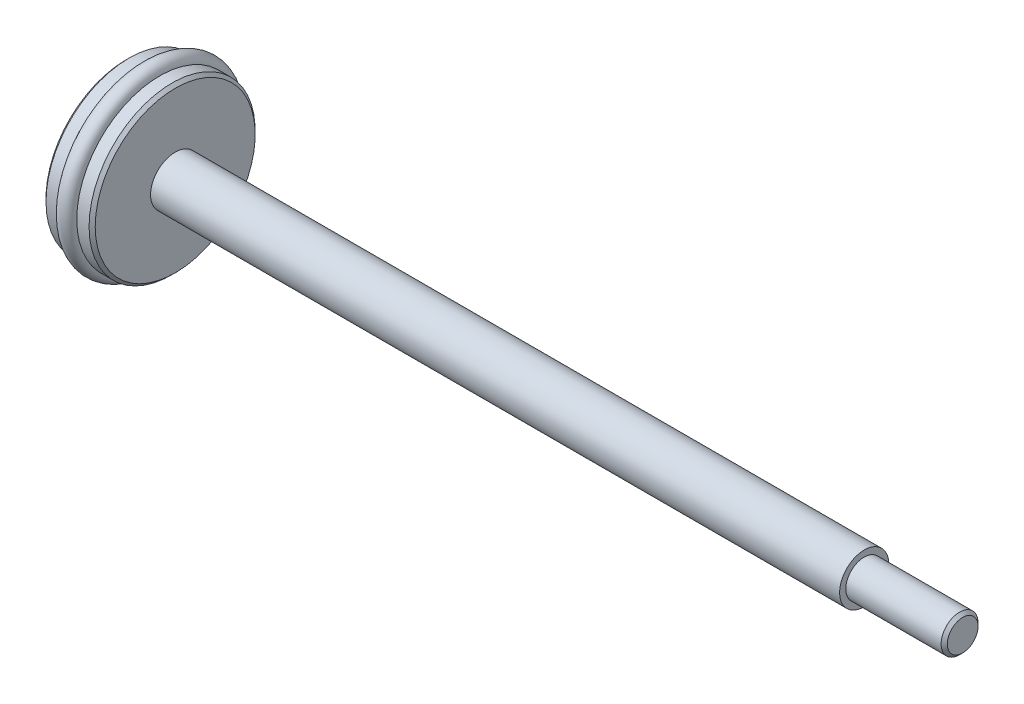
ISO-10303-21;
HEADER;
FILE_DESCRIPTION(('STEP AP214'),'2;1');
FILE_NAME('part.step','',(''),(''),'','','');
FILE_SCHEMA(('AUTOMOTIVE_DESIGN { 1 0 10303 214 1 1 1 1 }'));
ENDSEC;
DATA;
#1=APPLICATION_CONTEXT('core data for automotive mechanical design processes');
#2=APPLICATION_PROTOCOL_DEFINITION('international standard','automotive_design',2000,#1);
#3=PRODUCT_CONTEXT('',#1,'mechanical');
#4=PRODUCT('Part','Part','',(#3));
#5=PRODUCT_RELATED_PRODUCT_CATEGORY('part','',(#4));
#6=PRODUCT_DEFINITION_FORMATION('','',#4);
#7=PRODUCT_DEFINITION_CONTEXT('part definition',#1,'design');
#8=PRODUCT_DEFINITION('design','',#6,#7);
#9=PRODUCT_DEFINITION_SHAPE('','',#8);
#10=(LENGTH_UNIT() NAMED_UNIT(*) SI_UNIT(.MILLI.,.METRE.));
#11=(NAMED_UNIT(*) PLANE_ANGLE_UNIT() SI_UNIT($,.RADIAN.));
#12=(NAMED_UNIT(*) SI_UNIT($,.STERADIAN.) SOLID_ANGLE_UNIT());
#13=UNCERTAINTY_MEASURE_WITH_UNIT(LENGTH_MEASURE(1.E-05),#10,'distance_accuracy_value','');
#14=(GEOMETRIC_REPRESENTATION_CONTEXT(3) GLOBAL_UNCERTAINTY_ASSIGNED_CONTEXT((#13)) GLOBAL_UNIT_ASSIGNED_CONTEXT((#10,
#11,#12)) REPRESENTATION_CONTEXT('',''));
#15=CARTESIAN_POINT('',(0.,0.,0.));
#16=DIRECTION('',(0.,0.,1.));
#17=DIRECTION('',(1.,0.,0.));
#18=AXIS2_PLACEMENT_3D('',#15,#16,#17);
#19=CARTESIAN_POINT('',(7.99404103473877,0.,0.));
#20=DIRECTION('',(-1.,0.,0.));
#21=DIRECTION('',(0.,0.,1.));
#22=AXIS2_PLACEMENT_3D('',#19,#20,#21);
#23=TOROIDAL_SURFACE('',#22,26.7256412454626,2.77304253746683);
#24=CARTESIAN_POINT('',(7.99404103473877,0.,29.4986837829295));
#25=VERTEX_POINT('',#24);
#26=VERTEX_LOOP('',#25);
#27=FACE_BOUND('',#26,.T.);
#28=ADVANCED_FACE('F38',(#27),#23,.T.);
#29=CLOSED_SHELL('',(#28));
#30=MANIFOLD_SOLID_BREP('B2',#29);
#31=CARTESIAN_POINT('',(0.,26.,0.));
#32=DIRECTION('',(1.,0.,0.));
#33=DIRECTION('',(0.,0.,-1.));
#34=AXIS2_PLACEMENT_3D('',#31,#32,#33);
#35=PLANE('',#34);
#36=CARTESIAN_POINT('',(0.,0.,0.));
#37=DIRECTION('',(-1.,0.,0.));
#38=DIRECTION('',(0.,0.,1.));
#39=AXIS2_PLACEMENT_3D('',#36,#37,#38);
#40=CIRCLE('',#39,26.);
#41=CARTESIAN_POINT('',(0.,0.,-26.));
#42=VERTEX_POINT('',#41);
#43=EDGE_CURVE('E37',#42,#42,#40,.T.);
#44=ORIENTED_EDGE('',*,*,#43,.T.);
#45=EDGE_LOOP('',(#44));
#46=FACE_BOUND('',#45,.T.);
#47=ADVANCED_FACE('F48',(#46),#35,.F.);
#48=CARTESIAN_POINT('',(1.,0.,0.));
#49=DIRECTION('',(1.,0.,0.));
#50=DIRECTION('',(0.,0.,-1.));
#51=AXIS2_PLACEMENT_3D('',#48,#49,#50);
#52=CONICAL_SURFACE('',#51,27.,0.78539816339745);
#53=CARTESIAN_POINT('',(1.,0.,0.));
#54=DIRECTION('',(-1.,0.,0.));
#55=DIRECTION('',(0.,0.,1.));
#56=AXIS2_PLACEMENT_3D('',#53,#54,#55);
#57=CIRCLE('',#56,27.);
#58=CARTESIAN_POINT('',(1.,0.,-27.));
#59=VERTEX_POINT('',#58);
#60=EDGE_CURVE('E55',#59,#59,#57,.T.);
#61=CARTESIAN_POINT('',(0.,0.,-26.));
#62=CARTESIAN_POINT('',(0.0104166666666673,0.,-26.0104166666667));
#63=CARTESIAN_POINT('',(0.020833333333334,0.,-26.0208333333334));
#64=CARTESIAN_POINT('',(0.0416666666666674,0.,-26.0416666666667));
#65=CARTESIAN_POINT('',(0.052083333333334,0.,-26.0520833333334));
#66=CARTESIAN_POINT('',(0.0729166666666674,0.,-26.0729166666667));
#67=CARTESIAN_POINT('',(0.0833333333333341,0.,-26.0833333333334));
#68=CARTESIAN_POINT('',(0.104166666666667,0.,-26.1041666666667));
#69=CARTESIAN_POINT('',(0.114583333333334,0.,-26.1145833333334));
#70=CARTESIAN_POINT('',(0.135416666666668,0.,-26.1354166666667));
#71=CARTESIAN_POINT('',(0.145833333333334,0.,-26.1458333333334));
#72=CARTESIAN_POINT('',(0.166666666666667,0.,-26.1666666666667));
#73=CARTESIAN_POINT('',(0.177083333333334,0.,-26.1770833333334));
#74=CARTESIAN_POINT('',(0.197916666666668,0.,-26.1979166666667));
#75=CARTESIAN_POINT('',(0.208333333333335,0.,-26.2083333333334));
#76=CARTESIAN_POINT('',(0.229166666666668,0.,-26.2291666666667));
#77=CARTESIAN_POINT('',(0.239583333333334,0.,-26.2395833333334));
#78=CARTESIAN_POINT('',(0.260416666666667,0.,-26.2604166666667));
#79=CARTESIAN_POINT('',(0.270833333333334,0.,-26.2708333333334));
#80=CARTESIAN_POINT('',(0.291666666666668,0.,-26.2916666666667));
#81=CARTESIAN_POINT('',(0.302083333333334,0.,-26.3020833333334));
#82=CARTESIAN_POINT('',(0.322916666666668,0.,-26.3229166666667));
#83=CARTESIAN_POINT('',(0.333333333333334,0.,-26.3333333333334));
#84=CARTESIAN_POINT('',(0.354166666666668,0.,-26.3541666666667));
#85=CARTESIAN_POINT('',(0.364583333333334,0.,-26.3645833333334));
#86=CARTESIAN_POINT('',(0.385416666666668,0.,-26.3854166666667));
#87=CARTESIAN_POINT('',(0.395833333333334,0.,-26.3958333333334));
#88=CARTESIAN_POINT('',(0.416666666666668,0.,-26.4166666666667));
#89=CARTESIAN_POINT('',(0.427083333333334,0.,-26.4270833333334));
#90=CARTESIAN_POINT('',(0.447916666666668,0.,-26.4479166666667));
#91=CARTESIAN_POINT('',(0.458333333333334,0.,-26.4583333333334));
#92=CARTESIAN_POINT('',(0.479166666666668,0.,-26.4791666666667));
#93=CARTESIAN_POINT('',(0.489583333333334,0.,-26.4895833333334));
#94=CARTESIAN_POINT('',(0.510416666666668,0.,-26.5104166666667));
#95=CARTESIAN_POINT('',(0.520833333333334,0.,-26.5208333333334));
#96=CARTESIAN_POINT('',(0.541666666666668,0.,-26.5416666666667));
#97=CARTESIAN_POINT('',(0.552083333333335,0.,-26.5520833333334));
#98=CARTESIAN_POINT('',(0.572916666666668,0.,-26.5729166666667));
#99=CARTESIAN_POINT('',(0.583333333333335,0.,-26.5833333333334));
#100=CARTESIAN_POINT('',(0.604166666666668,0.,-26.6041666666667));
#101=CARTESIAN_POINT('',(0.614583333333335,0.,-26.6145833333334));
#102=CARTESIAN_POINT('',(0.635416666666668,0.,-26.6354166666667));
#103=CARTESIAN_POINT('',(0.645833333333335,0.,-26.6458333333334));
#104=CARTESIAN_POINT('',(0.666666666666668,0.,-26.6666666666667));
#105=CARTESIAN_POINT('',(0.677083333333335,0.,-26.6770833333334));
#106=CARTESIAN_POINT('',(0.697916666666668,0.,-26.6979166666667));
#107=CARTESIAN_POINT('',(0.708333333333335,0.,-26.7083333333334));
#108=CARTESIAN_POINT('',(0.729166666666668,0.,-26.7291666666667));
#109=CARTESIAN_POINT('',(0.739583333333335,0.,-26.7395833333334));
#110=CARTESIAN_POINT('',(0.760416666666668,0.,-26.7604166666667));
#111=CARTESIAN_POINT('',(0.770833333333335,0.,-26.7708333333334));
#112=CARTESIAN_POINT('',(0.791666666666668,0.,-26.7916666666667));
#113=CARTESIAN_POINT('',(0.802083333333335,0.,-26.8020833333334));
#114=CARTESIAN_POINT('',(0.822916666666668,0.,-26.8229166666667));
#115=CARTESIAN_POINT('',(0.833333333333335,0.,-26.8333333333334));
#116=CARTESIAN_POINT('',(0.854166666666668,0.,-26.8541666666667));
#117=CARTESIAN_POINT('',(0.864583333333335,0.,-26.8645833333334));
#118=CARTESIAN_POINT('',(0.885416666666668,0.,-26.8854166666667));
#119=CARTESIAN_POINT('',(0.895833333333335,0.,-26.8958333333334));
#120=CARTESIAN_POINT('',(0.916666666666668,0.,-26.9166666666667));
#121=CARTESIAN_POINT('',(0.927083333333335,0.,-26.9270833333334));
#122=CARTESIAN_POINT('',(0.947916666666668,0.,-26.9479166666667));
#123=CARTESIAN_POINT('',(0.958333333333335,0.,-26.9583333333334));
#124=CARTESIAN_POINT('',(0.979166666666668,0.,-26.9791666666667));
#125=CARTESIAN_POINT('',(0.989583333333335,0.,-26.9895833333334));
#126=CARTESIAN_POINT('',(1.,0.,-27.));
#127=B_SPLINE_CURVE_WITH_KNOTS('',3,(#61,#62,#63,#64,#65,#66,#67,#68,#69,#70,#71,#72,#73,#74,
#75,#76,#77,#78,#79,#80,#81,#82,#83,#84,#85,#86,#87,#88,#89,#90,#91,#92,#93,#94,#95,#96,#97,#98,
#99,#100,#101,#102,#103,#104,#105,#106,#107,#108,#109,#110,#111,#112,#113,#114,#115,#116,#117,
#118,#119,#120,#121,#122,#123,#124,#125,#126),.UNSPECIFIED.,.F.,.F.,(4,2,2,2,2,2,2,2,2,2,2,2,2,
2,2,2,2,2,2,2,2,2,2,2,2,2,2,2,2,2,2,2,4),(0.,0.0441941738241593,0.0883883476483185,
0.132582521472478,0.176776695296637,0.220970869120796,0.265165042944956,0.309359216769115,
0.353553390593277,0.397747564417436,0.441941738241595,0.486135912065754,0.530330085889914,
0.574524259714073,0.618718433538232,0.662912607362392,0.707106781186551,0.75130095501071,
0.795495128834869,0.839689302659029,0.883883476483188,0.928077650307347,0.972271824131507,
1.01646599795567,1.06066017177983,1.10485434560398,1.14904851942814,1.1932426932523,
1.23743686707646,1.28163104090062,1.32582521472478,1.37001938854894,1.4142135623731),.UNSPECIFIED.);
#128=EDGE_CURVE('BSEAM110',#42,#59,#127,.T.);
#129=ORIENTED_EDGE('',*,*,#43,.F.);
#130=ORIENTED_EDGE('',*,*,#60,.T.);
#131=ORIENTED_EDGE('',*,*,#128,.T.);
#132=ORIENTED_EDGE('',*,*,#128,.F.);
#133=EDGE_LOOP('',(#129,#131,#130,#132));
#134=FACE_BOUND('',#133,.T.);
#135=ADVANCED_FACE('F110',(#134),#52,.T.);
#136=CARTESIAN_POINT('',(-30.4059878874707,0.,0.));
#137=DIRECTION('',(-1.,0.,0.));
#138=DIRECTION('',(0.,0.,1.));
#139=AXIS2_PLACEMENT_3D('',#136,#137,#138);
#140=CYLINDRICAL_SURFACE('',#139,27.);
#141=ORIENTED_EDGE('',*,*,#60,.F.);
#142=EDGE_LOOP('',(#141));
#143=FACE_BOUND('',#142,.T.);
#144=CARTESIAN_POINT('',(5.,0.,0.));
#145=DIRECTION('',(-1.,0.,0.));
#146=DIRECTION('',(0.,0.,1.));
#147=AXIS2_PLACEMENT_3D('',#144,#145,#146);
#148=CIRCLE('',#147,27.);
#149=CARTESIAN_POINT('',(5.,0.,27.0000000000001));
#150=VERTEX_POINT('',#149);
#151=EDGE_CURVE('E61',#150,#150,#148,.T.);
#152=ORIENTED_EDGE('',*,*,#151,.T.);
#153=EDGE_LOOP('',(#152));
#154=FACE_BOUND('',#153,.T.);
#155=ADVANCED_FACE('F114',(#143,#154),#140,.T.);
#156=CARTESIAN_POINT('',(5.75000000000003,0.,0.));
#157=DIRECTION('',(-1.,0.,0.));
#158=DIRECTION('',(0.,0.,1.));
#159=AXIS2_PLACEMENT_3D('',#156,#157,#158);
#160=CONICAL_SURFACE('',#159,23.9,1.33342207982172);
#161=CARTESIAN_POINT('',(5.75000000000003,0.,0.));
#162=DIRECTION('',(-1.,0.,0.));
#163=DIRECTION('',(0.,0.,1.));
#164=AXIS2_PLACEMENT_3D('',#161,#162,#163);
#165=CIRCLE('',#164,23.9);
#166=CARTESIAN_POINT('',(5.75000000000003,0.,23.9));
#167=VERTEX_POINT('',#166);
#168=EDGE_CURVE('E65',#167,#167,#165,.T.);
#169=CARTESIAN_POINT('',(5.,0.,27.0000000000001));
#170=CARTESIAN_POINT('',(5.0078125,0.,26.9677083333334));
#171=CARTESIAN_POINT('',(5.015625,0.,26.9354166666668));
#172=CARTESIAN_POINT('',(5.03125,0.,26.8708333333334));
#173=CARTESIAN_POINT('',(5.03906250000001,0.,26.8385416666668));
#174=CARTESIAN_POINT('',(5.05468750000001,0.,26.7739583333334));
#175=CARTESIAN_POINT('',(5.06250000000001,0.,26.7416666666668));
#176=CARTESIAN_POINT('',(5.07812500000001,0.,26.6770833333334));
#177=CARTESIAN_POINT('',(5.08593750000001,0.,26.6447916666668));
#178=CARTESIAN_POINT('',(5.10156250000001,0.,26.5802083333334));
#179=CARTESIAN_POINT('',(5.10937500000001,0.,26.5479166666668));
#180=CARTESIAN_POINT('',(5.12500000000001,0.,26.4833333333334));
#181=CARTESIAN_POINT('',(5.13281250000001,0.,26.4510416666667));
#182=CARTESIAN_POINT('',(5.14843750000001,0.,26.3864583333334));
#183=CARTESIAN_POINT('',(5.15625000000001,0.,26.3541666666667));
#184=CARTESIAN_POINT('',(5.17187500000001,0.,26.2895833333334));
#185=CARTESIAN_POINT('',(5.17968750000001,0.,26.2572916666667));
#186=CARTESIAN_POINT('',(5.19531250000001,0.,26.1927083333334));
#187=CARTESIAN_POINT('',(5.20312500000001,0.,26.1604166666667));
#188=CARTESIAN_POINT('',(5.21875000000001,0.,26.0958333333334));
#189=CARTESIAN_POINT('',(5.22656250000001,0.,26.0635416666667));
#190=CARTESIAN_POINT('',(5.24218750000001,0.,25.9989583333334));
#191=CARTESIAN_POINT('',(5.25000000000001,0.,25.9666666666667));
#192=CARTESIAN_POINT('',(5.26562500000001,0.,25.9020833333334));
#193=CARTESIAN_POINT('',(5.27343750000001,0.,25.8697916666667));
#194=CARTESIAN_POINT('',(5.28906250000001,0.,25.8052083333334));
#195=CARTESIAN_POINT('',(5.29687500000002,0.,25.7729166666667));
#196=CARTESIAN_POINT('',(5.31250000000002,0.,25.7083333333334));
#197=CARTESIAN_POINT('',(5.32031250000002,0.,25.6760416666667));
#198=CARTESIAN_POINT('',(5.33593750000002,0.,25.6114583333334));
#199=CARTESIAN_POINT('',(5.34375000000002,0.,25.5791666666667));
#200=CARTESIAN_POINT('',(5.35937500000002,0.,25.5145833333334));
#201=CARTESIAN_POINT('',(5.36718750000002,0.,25.4822916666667));
#202=CARTESIAN_POINT('',(5.38281250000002,0.,25.4177083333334));
#203=CARTESIAN_POINT('',(5.39062500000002,0.,25.3854166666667));
#204=CARTESIAN_POINT('',(5.40625000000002,0.,25.3208333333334));
#205=CARTESIAN_POINT('',(5.41406250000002,0.,25.2885416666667));
#206=CARTESIAN_POINT('',(5.42968750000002,0.,25.2239583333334));
#207=CARTESIAN_POINT('',(5.43750000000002,0.,25.1916666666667));
#208=CARTESIAN_POINT('',(5.45312500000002,0.,25.1270833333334));
#209=CARTESIAN_POINT('',(5.46093750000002,0.,25.0947916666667));
#210=CARTESIAN_POINT('',(5.47656250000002,0.,25.0302083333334));
#211=CARTESIAN_POINT('',(5.48437500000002,0.,24.9979166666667));
#212=CARTESIAN_POINT('',(5.50000000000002,0.,24.9333333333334));
#213=CARTESIAN_POINT('',(5.50781250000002,0.,24.9010416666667));
#214=CARTESIAN_POINT('',(5.52343750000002,0.,24.8364583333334));
#215=CARTESIAN_POINT('',(5.53125000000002,0.,24.8041666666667));
#216=CARTESIAN_POINT('',(5.54687500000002,0.,24.7395833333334));
#217=CARTESIAN_POINT('',(5.55468750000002,0.,24.7072916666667));
#218=CARTESIAN_POINT('',(5.57031250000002,0.,24.6427083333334));
#219=CARTESIAN_POINT('',(5.57812500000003,0.,24.6104166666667));
#220=CARTESIAN_POINT('',(5.59375000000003,0.,24.5458333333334));
#221=CARTESIAN_POINT('',(5.60156250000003,0.,24.5135416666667));
#222=CARTESIAN_POINT('',(5.61718750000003,0.,24.4489583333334));
#223=CARTESIAN_POINT('',(5.62500000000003,0.,24.4166666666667));
#224=CARTESIAN_POINT('',(5.64062500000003,0.,24.3520833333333));
#225=CARTESIAN_POINT('',(5.64843750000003,0.,24.3197916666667));
#226=CARTESIAN_POINT('',(5.66406250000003,0.,24.2552083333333));
#227=CARTESIAN_POINT('',(5.67187500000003,0.,24.2229166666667));
#228=CARTESIAN_POINT('',(5.68750000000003,0.,24.1583333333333));
#229=CARTESIAN_POINT('',(5.69531250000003,0.,24.1260416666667));
#230=CARTESIAN_POINT('',(5.71093750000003,0.,24.0614583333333));
#231=CARTESIAN_POINT('',(5.71875000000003,0.,24.0291666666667));
#232=CARTESIAN_POINT('',(5.73437500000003,0.,23.9645833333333));
#233=CARTESIAN_POINT('',(5.74218750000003,0.,23.9322916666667));
#234=CARTESIAN_POINT('',(5.75000000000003,0.,23.9));
#235=B_SPLINE_CURVE_WITH_KNOTS('',3,(#169,#170,#171,#172,#173,#174,#175,#176,#177,#178,#179,
#180,#181,#182,#183,#184,#185,#186,#187,#188,#189,#190,#191,#192,#193,#194,#195,#196,#197,#198,
#199,#200,#201,#202,#203,#204,#205,#206,#207,#208,#209,#210,#211,#212,#213,#214,#215,#216,#217,
#218,#219,#220,#221,#222,#223,#224,#225,#226,#227,#228,#229,#230,#231,#232,#233,#234),
.UNSPECIFIED.,.F.,.F.,(4,2,2,2,2,2,2,2,2,2,2,2,2,2,2,2,2,2,2,2,2,2,2,2,2,2,2,2,2,2,2,2,4),(0.,
0.09966986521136,0.19933973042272,0.29900959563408,0.39867946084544,0.498349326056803,
0.598019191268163,0.697689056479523,0.797358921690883,0.897028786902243,0.996698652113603,
1.09636851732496,1.19603838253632,1.29570824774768,1.39537811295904,1.4950479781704,
1.59471784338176,1.69438770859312,1.79405757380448,1.89372743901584,1.9933973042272,
2.09306716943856,2.19273703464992,2.29240689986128,2.39207676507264,2.491746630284,
2.59141649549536,2.69108636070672,2.79075622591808,2.89042609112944,2.9900959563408,
3.08976582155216,3.18943568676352),.UNSPECIFIED.);
#236=EDGE_CURVE('BSEAM119',#150,#167,#235,.T.);
#237=ORIENTED_EDGE('',*,*,#151,.F.);
#238=ORIENTED_EDGE('',*,*,#168,.T.);
#239=ORIENTED_EDGE('',*,*,#236,.T.);
#240=ORIENTED_EDGE('',*,*,#236,.F.);
#241=EDGE_LOOP('',(#237,#239,#238,#240));
#242=FACE_BOUND('',#241,.T.);
#243=ADVANCED_FACE('F119',(#242),#160,.T.);
#244=CARTESIAN_POINT('',(-30.4059878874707,0.,0.));
#245=DIRECTION('',(-1.,0.,0.));
#246=DIRECTION('',(0.,0.,1.));
#247=AXIS2_PLACEMENT_3D('',#244,#245,#246);
#248=CYLINDRICAL_SURFACE('',#247,23.9);
#249=CARTESIAN_POINT('',(10.25,0.,0.));
#250=DIRECTION('',(-1.,0.,0.));
#251=DIRECTION('',(0.,0.,1.));
#252=AXIS2_PLACEMENT_3D('',#249,#250,#251);
#253=CIRCLE('',#252,23.9);
#254=CARTESIAN_POINT('',(10.25,0.,23.9));
#255=VERTEX_POINT('',#254);
#256=EDGE_CURVE('E70',#255,#255,#253,.T.);
#257=CARTESIAN_POINT('',(5.75000000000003,0.,23.9));
#258=CARTESIAN_POINT('',(5.79687500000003,0.,23.9));
#259=CARTESIAN_POINT('',(5.84375000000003,0.,23.9));
#260=CARTESIAN_POINT('',(5.93750000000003,0.,23.9));
#261=CARTESIAN_POINT('',(5.98437500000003,0.,23.9));
#262=CARTESIAN_POINT('',(6.07812500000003,0.,23.9));
#263=CARTESIAN_POINT('',(6.12500000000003,0.,23.9));
#264=CARTESIAN_POINT('',(6.21875000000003,0.,23.9));
#265=CARTESIAN_POINT('',(6.26562500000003,0.,23.9));
#266=CARTESIAN_POINT('',(6.35937500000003,0.,23.9));
#267=CARTESIAN_POINT('',(6.40625000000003,0.,23.9));
#268=CARTESIAN_POINT('',(6.50000000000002,0.,23.9));
#269=CARTESIAN_POINT('',(6.54687500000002,0.,23.9));
#270=CARTESIAN_POINT('',(6.64062500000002,0.,23.9));
#271=CARTESIAN_POINT('',(6.68750000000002,0.,23.9));
#272=CARTESIAN_POINT('',(6.78125000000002,0.,23.9));
#273=CARTESIAN_POINT('',(6.82812500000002,0.,23.9));
#274=CARTESIAN_POINT('',(6.92187500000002,0.,23.9));
#275=CARTESIAN_POINT('',(6.96875000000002,0.,23.9));
#276=CARTESIAN_POINT('',(7.06250000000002,0.,23.9));
#277=CARTESIAN_POINT('',(7.10937500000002,0.,23.9));
#278=CARTESIAN_POINT('',(7.20312500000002,0.,23.9));
#279=CARTESIAN_POINT('',(7.25000000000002,0.,23.9));
#280=CARTESIAN_POINT('',(7.34375000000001,0.,23.9));
#281=CARTESIAN_POINT('',(7.39062500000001,0.,23.9));
#282=CARTESIAN_POINT('',(7.48437500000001,0.,23.9));
#283=CARTESIAN_POINT('',(7.53125000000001,0.,23.9));
#284=CARTESIAN_POINT('',(7.62500000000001,0.,23.9));
#285=CARTESIAN_POINT('',(7.67187500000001,0.,23.9));
#286=CARTESIAN_POINT('',(7.76562500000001,0.,23.9));
#287=CARTESIAN_POINT('',(7.81250000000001,0.,23.9));
#288=CARTESIAN_POINT('',(7.90625000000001,0.,23.9));
#289=CARTESIAN_POINT('',(7.95312500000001,0.,23.9));
#290=CARTESIAN_POINT('',(8.04687500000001,0.,23.9));
#291=CARTESIAN_POINT('',(8.09375000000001,0.,23.9));
#292=CARTESIAN_POINT('',(8.18750000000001,0.,23.9));
#293=CARTESIAN_POINT('',(8.234375,0.,23.9));
#294=CARTESIAN_POINT('',(8.328125,0.,23.9));
#295=CARTESIAN_POINT('',(8.375,0.,23.9));
#296=CARTESIAN_POINT('',(8.46875,0.,23.9));
#297=CARTESIAN_POINT('',(8.515625,0.,23.9));
#298=CARTESIAN_POINT('',(8.609375,0.,23.9));
#299=CARTESIAN_POINT('',(8.65624999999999,0.,23.9));
#300=CARTESIAN_POINT('',(8.74999999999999,0.,23.9));
#301=CARTESIAN_POINT('',(8.79687499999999,0.,23.9));
#302=CARTESIAN_POINT('',(8.89062499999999,0.,23.9));
#303=CARTESIAN_POINT('',(8.93749999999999,0.,23.9));
#304=CARTESIAN_POINT('',(9.03124999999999,0.,23.9));
#305=CARTESIAN_POINT('',(9.07812499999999,0.,23.9));
#306=CARTESIAN_POINT('',(9.17187499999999,0.,23.9));
#307=CARTESIAN_POINT('',(9.21874999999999,0.,23.9));
#308=CARTESIAN_POINT('',(9.31249999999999,0.,23.9));
#309=CARTESIAN_POINT('',(9.35937499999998,0.,23.9));
#310=CARTESIAN_POINT('',(9.45312499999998,0.,23.9));
#311=CARTESIAN_POINT('',(9.49999999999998,0.,23.9));
#312=CARTESIAN_POINT('',(9.59374999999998,0.,23.9));
#313=CARTESIAN_POINT('',(9.64062499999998,0.,23.9));
#314=CARTESIAN_POINT('',(9.73437499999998,0.,23.9));
#315=CARTESIAN_POINT('',(9.78124999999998,0.,23.9));
#316=CARTESIAN_POINT('',(9.87499999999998,0.,23.9));
#317=CARTESIAN_POINT('',(9.92187499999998,0.,23.9));
#318=CARTESIAN_POINT('',(10.015625,0.,23.9));
#319=CARTESIAN_POINT('',(10.0625,0.,23.9));
#320=CARTESIAN_POINT('',(10.15625,0.,23.9));
#321=CARTESIAN_POINT('',(10.203125,0.,23.9));
#322=CARTESIAN_POINT('',(10.25,0.,23.9));
#323=B_SPLINE_CURVE_WITH_KNOTS('',3,(#257,#258,#259,#260,#261,#262,#263,#264,#265,#266,#267,
#268,#269,#270,#271,#272,#273,#274,#275,#276,#277,#278,#279,#280,#281,#282,#283,#284,#285,#286,
#287,#288,#289,#290,#291,#292,#293,#294,#295,#296,#297,#298,#299,#300,#301,#302,#303,#304,#305,
#306,#307,#308,#309,#310,#311,#312,#313,#314,#315,#316,#317,#318,#319,#320,#321,#322),
.UNSPECIFIED.,.F.,.F.,(4,2,2,2,2,2,2,2,2,2,2,2,2,2,2,2,2,2,2,2,2,2,2,2,2,2,2,2,2,2,2,2,4),(0.,
0.140624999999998,0.281249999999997,0.421874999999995,0.562499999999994,0.703124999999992,
0.84374999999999,0.984374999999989,1.12499999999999,1.26562499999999,1.40624999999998,
1.54687499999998,1.68749999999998,1.82812499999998,1.96874999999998,2.10937499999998,
2.24999999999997,2.39062499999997,2.53124999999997,2.67187499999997,2.81249999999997,
2.95312499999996,3.09374999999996,3.23437499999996,3.37499999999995,3.51562499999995,
3.65624999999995,3.79687499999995,3.93749999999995,4.07812499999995,4.21874999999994,
4.35937499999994,4.49999999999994),.UNSPECIFIED.);
#324=EDGE_CURVE('BSEAM125',#167,#255,#323,.T.);
#325=ORIENTED_EDGE('',*,*,#168,.F.);
#326=ORIENTED_EDGE('',*,*,#256,.T.);
#327=ORIENTED_EDGE('',*,*,#324,.T.);
#328=ORIENTED_EDGE('',*,*,#324,.F.);
#329=EDGE_LOOP('',(#325,#327,#326,#328));
#330=FACE_BOUND('',#329,.T.);
#331=ADVANCED_FACE('F125',(#330),#248,.T.);
#332=CARTESIAN_POINT('',(11.,0.,0.));
#333=DIRECTION('',(1.,0.,0.));
#334=DIRECTION('',(0.,0.,-1.));
#335=AXIS2_PLACEMENT_3D('',#332,#333,#334);
#336=CONICAL_SURFACE('',#335,27.,1.33342207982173);
#337=ORIENTED_EDGE('',*,*,#256,.F.);
#338=EDGE_LOOP('',(#337));
#339=FACE_BOUND('',#338,.T.);
#340=CARTESIAN_POINT('',(11.,0.,0.));
#341=DIRECTION('',(-1.,0.,0.));
#342=DIRECTION('',(0.,0.,1.));
#343=AXIS2_PLACEMENT_3D('',#340,#341,#342);
#344=CIRCLE('',#343,27.);
#345=CARTESIAN_POINT('',(11.,0.,27.));
#346=VERTEX_POINT('',#345);
#347=EDGE_CURVE('E73',#346,#346,#344,.T.);
#348=ORIENTED_EDGE('',*,*,#347,.T.);
#349=EDGE_LOOP('',(#348));
#350=FACE_BOUND('',#349,.T.);
#351=ADVANCED_FACE('F129',(#339,#350),#336,.T.);
#352=CARTESIAN_POINT('',(-30.4059878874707,0.,0.));
#353=DIRECTION('',(-1.,0.,0.));
#354=DIRECTION('',(0.,0.,1.));
#355=AXIS2_PLACEMENT_3D('',#352,#353,#354);
#356=CYLINDRICAL_SURFACE('',#355,27.);
#357=CARTESIAN_POINT('',(15.,0.,0.));
#358=DIRECTION('',(-1.,0.,0.));
#359=DIRECTION('',(0.,0.,1.));
#360=AXIS2_PLACEMENT_3D('',#357,#358,#359);
#361=CIRCLE('',#360,27.);
#362=CARTESIAN_POINT('',(15.,0.,27.));
#363=VERTEX_POINT('',#362);
#364=EDGE_CURVE('E76',#363,#363,#361,.T.);
#365=CARTESIAN_POINT('',(11.,0.,27.));
#366=CARTESIAN_POINT('',(11.0416666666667,0.,27.));
#367=CARTESIAN_POINT('',(11.0833333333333,0.,27.));
#368=CARTESIAN_POINT('',(11.1666666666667,0.,27.));
#369=CARTESIAN_POINT('',(11.2083333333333,0.,27.));
#370=CARTESIAN_POINT('',(11.2916666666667,0.,27.));
#371=CARTESIAN_POINT('',(11.3333333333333,0.,27.));
#372=CARTESIAN_POINT('',(11.4166666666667,0.,27.));
#373=CARTESIAN_POINT('',(11.4583333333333,0.,27.));
#374=CARTESIAN_POINT('',(11.5416666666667,0.,27.));
#375=CARTESIAN_POINT('',(11.5833333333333,0.,27.));
#376=CARTESIAN_POINT('',(11.6666666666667,0.,27.));
#377=CARTESIAN_POINT('',(11.7083333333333,0.,27.));
#378=CARTESIAN_POINT('',(11.7916666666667,0.,27.));
#379=CARTESIAN_POINT('',(11.8333333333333,0.,27.));
#380=CARTESIAN_POINT('',(11.9166666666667,0.,27.));
#381=CARTESIAN_POINT('',(11.9583333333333,0.,27.));
#382=CARTESIAN_POINT('',(12.0416666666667,0.,27.));
#383=CARTESIAN_POINT('',(12.0833333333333,0.,27.));
#384=CARTESIAN_POINT('',(12.1666666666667,0.,27.));
#385=CARTESIAN_POINT('',(12.2083333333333,0.,27.));
#386=CARTESIAN_POINT('',(12.2916666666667,0.,27.));
#387=CARTESIAN_POINT('',(12.3333333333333,0.,27.));
#388=CARTESIAN_POINT('',(12.4166666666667,0.,27.));
#389=CARTESIAN_POINT('',(12.4583333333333,0.,27.));
#390=CARTESIAN_POINT('',(12.5416666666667,0.,27.));
#391=CARTESIAN_POINT('',(12.5833333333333,0.,27.));
#392=CARTESIAN_POINT('',(12.6666666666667,0.,27.));
#393=CARTESIAN_POINT('',(12.7083333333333,0.,27.));
#394=CARTESIAN_POINT('',(12.7916666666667,0.,27.));
#395=CARTESIAN_POINT('',(12.8333333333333,0.,27.));
#396=CARTESIAN_POINT('',(12.9166666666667,0.,27.));
#397=CARTESIAN_POINT('',(12.9583333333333,0.,27.));
#398=CARTESIAN_POINT('',(13.0416666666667,0.,27.));
#399=CARTESIAN_POINT('',(13.0833333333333,0.,27.));
#400=CARTESIAN_POINT('',(13.1666666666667,0.,27.));
#401=CARTESIAN_POINT('',(13.2083333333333,0.,27.));
#402=CARTESIAN_POINT('',(13.2916666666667,0.,27.));
#403=CARTESIAN_POINT('',(13.3333333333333,0.,27.));
#404=CARTESIAN_POINT('',(13.4166666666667,0.,27.));
#405=CARTESIAN_POINT('',(13.4583333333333,0.,27.));
#406=CARTESIAN_POINT('',(13.5416666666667,0.,27.));
#407=CARTESIAN_POINT('',(13.5833333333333,0.,27.));
#408=CARTESIAN_POINT('',(13.6666666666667,0.,27.));
#409=CARTESIAN_POINT('',(13.7083333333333,0.,27.));
#410=CARTESIAN_POINT('',(13.7916666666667,0.,27.));
#411=CARTESIAN_POINT('',(13.8333333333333,0.,27.));
#412=CARTESIAN_POINT('',(13.9166666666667,0.,27.));
#413=CARTESIAN_POINT('',(13.9583333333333,0.,27.));
#414=CARTESIAN_POINT('',(14.0416666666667,0.,27.));
#415=CARTESIAN_POINT('',(14.0833333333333,0.,27.));
#416=CARTESIAN_POINT('',(14.1666666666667,0.,27.));
#417=CARTESIAN_POINT('',(14.2083333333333,0.,27.));
#418=CARTESIAN_POINT('',(14.2916666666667,0.,27.));
#419=CARTESIAN_POINT('',(14.3333333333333,0.,27.));
#420=CARTESIAN_POINT('',(14.4166666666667,0.,27.));
#421=CARTESIAN_POINT('',(14.4583333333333,0.,27.));
#422=CARTESIAN_POINT('',(14.5416666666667,0.,27.));
#423=CARTESIAN_POINT('',(14.5833333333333,0.,27.));
#424=CARTESIAN_POINT('',(14.6666666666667,0.,27.));
#425=CARTESIAN_POINT('',(14.7083333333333,0.,27.));
#426=CARTESIAN_POINT('',(14.7916666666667,0.,27.));
#427=CARTESIAN_POINT('',(14.8333333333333,0.,27.));
#428=CARTESIAN_POINT('',(14.9166666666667,0.,27.));
#429=CARTESIAN_POINT('',(14.9583333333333,0.,27.));
#430=CARTESIAN_POINT('',(15.,0.,27.));
#431=B_SPLINE_CURVE_WITH_KNOTS('',3,(#365,#366,#367,#368,#369,#370,#371,#372,#373,#374,#375,
#376,#377,#378,#379,#380,#381,#382,#383,#384,#385,#386,#387,#388,#389,#390,#391,#392,#393,#394,
#395,#396,#397,#398,#399,#400,#401,#402,#403,#404,#405,#406,#407,#408,#409,#410,#411,#412,#413,
#414,#415,#416,#417,#418,#419,#420,#421,#422,#423,#424,#425,#426,#427,#428,#429,#430),
.UNSPECIFIED.,.F.,.F.,(4,2,2,2,2,2,2,2,2,2,2,2,2,2,2,2,2,2,2,2,2,2,2,2,2,2,2,2,2,2,2,2,4),(0.,
0.125,0.25,0.375,0.5,0.625000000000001,0.750000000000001,0.875000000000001,1.,1.125,1.25,1.375,
1.5,1.625,1.75,1.875,2.,2.125,2.25,2.375,2.5,2.625,2.75,2.875,3.,3.125,3.25,3.375,3.5,3.625,
3.75,3.875,4.),.UNSPECIFIED.);
#432=EDGE_CURVE('BSEAM133',#346,#363,#431,.T.);
#433=ORIENTED_EDGE('',*,*,#347,.F.);
#434=ORIENTED_EDGE('',*,*,#364,.T.);
#435=ORIENTED_EDGE('',*,*,#432,.T.);
#436=ORIENTED_EDGE('',*,*,#432,.F.);
#437=EDGE_LOOP('',(#433,#435,#434,#436));
#438=FACE_BOUND('',#437,.T.);
#439=ADVANCED_FACE('F133',(#438),#356,.T.);
#440=CARTESIAN_POINT('',(16.,0.,0.));
#441=DIRECTION('',(-1.,0.,0.));
#442=DIRECTION('',(0.,0.,1.));
#443=AXIS2_PLACEMENT_3D('',#440,#441,#442);
#444=CONICAL_SURFACE('',#443,26.,0.785398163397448);
#445=CARTESIAN_POINT('',(16.,0.,0.));
#446=DIRECTION('',(-1.,0.,0.));
#447=DIRECTION('',(0.,0.,1.));
#448=AXIS2_PLACEMENT_3D('',#445,#446,#447);
#449=CIRCLE('',#448,26.);
#450=CARTESIAN_POINT('',(16.,0.,26.));
#451=VERTEX_POINT('',#450);
#452=EDGE_CURVE('E79',#451,#451,#449,.T.);
#453=CARTESIAN_POINT('',(15.,0.,27.));
#454=CARTESIAN_POINT('',(15.0104166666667,0.,26.9895833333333));
#455=CARTESIAN_POINT('',(15.0208333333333,0.,26.9791666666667));
#456=CARTESIAN_POINT('',(15.0416666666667,0.,26.9583333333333));
#457=CARTESIAN_POINT('',(15.0520833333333,0.,26.9479166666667));
#458=CARTESIAN_POINT('',(15.0729166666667,0.,26.9270833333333));
#459=CARTESIAN_POINT('',(15.0833333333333,0.,26.9166666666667));
#460=CARTESIAN_POINT('',(15.1041666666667,0.,26.8958333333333));
#461=CARTESIAN_POINT('',(15.1145833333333,0.,26.8854166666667));
#462=CARTESIAN_POINT('',(15.1354166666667,0.,26.8645833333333));
#463=CARTESIAN_POINT('',(15.1458333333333,0.,26.8541666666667));
#464=CARTESIAN_POINT('',(15.1666666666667,0.,26.8333333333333));
#465=CARTESIAN_POINT('',(15.1770833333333,0.,26.8229166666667));
#466=CARTESIAN_POINT('',(15.1979166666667,0.,26.8020833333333));
#467=CARTESIAN_POINT('',(15.2083333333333,0.,26.7916666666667));
#468=CARTESIAN_POINT('',(15.2291666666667,0.,26.7708333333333));
#469=CARTESIAN_POINT('',(15.2395833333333,0.,26.7604166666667));
#470=CARTESIAN_POINT('',(15.2604166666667,0.,26.7395833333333));
#471=CARTESIAN_POINT('',(15.2708333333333,0.,26.7291666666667));
#472=CARTESIAN_POINT('',(15.2916666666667,0.,26.7083333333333));
#473=CARTESIAN_POINT('',(15.3020833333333,0.,26.6979166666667));
#474=CARTESIAN_POINT('',(15.3229166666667,0.,26.6770833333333));
#475=CARTESIAN_POINT('',(15.3333333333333,0.,26.6666666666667));
#476=CARTESIAN_POINT('',(15.3541666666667,0.,26.6458333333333));
#477=CARTESIAN_POINT('',(15.3645833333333,0.,26.6354166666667));
#478=CARTESIAN_POINT('',(15.3854166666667,0.,26.6145833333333));
#479=CARTESIAN_POINT('',(15.3958333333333,0.,26.6041666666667));
#480=CARTESIAN_POINT('',(15.4166666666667,0.,26.5833333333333));
#481=CARTESIAN_POINT('',(15.4270833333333,0.,26.5729166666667));
#482=CARTESIAN_POINT('',(15.4479166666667,0.,26.5520833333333));
#483=CARTESIAN_POINT('',(15.4583333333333,0.,26.5416666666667));
#484=CARTESIAN_POINT('',(15.4791666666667,0.,26.5208333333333));
#485=CARTESIAN_POINT('',(15.4895833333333,0.,26.5104166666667));
#486=CARTESIAN_POINT('',(15.5104166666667,0.,26.4895833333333));
#487=CARTESIAN_POINT('',(15.5208333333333,0.,26.4791666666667));
#488=CARTESIAN_POINT('',(15.5416666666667,0.,26.4583333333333));
#489=CARTESIAN_POINT('',(15.5520833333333,0.,26.4479166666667));
#490=CARTESIAN_POINT('',(15.5729166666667,0.,26.4270833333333));
#491=CARTESIAN_POINT('',(15.5833333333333,0.,26.4166666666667));
#492=CARTESIAN_POINT('',(15.6041666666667,0.,26.3958333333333));
#493=CARTESIAN_POINT('',(15.6145833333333,0.,26.3854166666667));
#494=CARTESIAN_POINT('',(15.6354166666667,0.,26.3645833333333));
#495=CARTESIAN_POINT('',(15.6458333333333,0.,26.3541666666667));
#496=CARTESIAN_POINT('',(15.6666666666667,0.,26.3333333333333));
#497=CARTESIAN_POINT('',(15.6770833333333,0.,26.3229166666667));
#498=CARTESIAN_POINT('',(15.6979166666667,0.,26.3020833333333));
#499=CARTESIAN_POINT('',(15.7083333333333,0.,26.2916666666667));
#500=CARTESIAN_POINT('',(15.7291666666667,0.,26.2708333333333));
#501=CARTESIAN_POINT('',(15.7395833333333,0.,26.2604166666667));
#502=CARTESIAN_POINT('',(15.7604166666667,0.,26.2395833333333));
#503=CARTESIAN_POINT('',(15.7708333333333,0.,26.2291666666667));
#504=CARTESIAN_POINT('',(15.7916666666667,0.,26.2083333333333));
#505=CARTESIAN_POINT('',(15.8020833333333,0.,26.1979166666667));
#506=CARTESIAN_POINT('',(15.8229166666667,0.,26.1770833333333));
#507=CARTESIAN_POINT('',(15.8333333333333,0.,26.1666666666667));
#508=CARTESIAN_POINT('',(15.8541666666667,0.,26.1458333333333));
#509=CARTESIAN_POINT('',(15.8645833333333,0.,26.1354166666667));
#510=CARTESIAN_POINT('',(15.8854166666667,0.,26.1145833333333));
#511=CARTESIAN_POINT('',(15.8958333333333,0.,26.1041666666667));
#512=CARTESIAN_POINT('',(15.9166666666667,0.,26.0833333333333));
#513=CARTESIAN_POINT('',(15.9270833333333,0.,26.0729166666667));
#514=CARTESIAN_POINT('',(15.9479166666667,0.,26.0520833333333));
#515=CARTESIAN_POINT('',(15.9583333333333,0.,26.0416666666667));
#516=CARTESIAN_POINT('',(15.9791666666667,0.,26.0208333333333));
#517=CARTESIAN_POINT('',(15.9895833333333,0.,26.0104166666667));
#518=CARTESIAN_POINT('',(16.,0.,26.));
#519=B_SPLINE_CURVE_WITH_KNOTS('',3,(#453,#454,#455,#456,#457,#458,#459,#460,#461,#462,#463,
#464,#465,#466,#467,#468,#469,#470,#471,#472,#473,#474,#475,#476,#477,#478,#479,#480,#481,#482,
#483,#484,#485,#486,#487,#488,#489,#490,#491,#492,#493,#494,#495,#496,#497,#498,#499,#500,#501,
#502,#503,#504,#505,#506,#507,#508,#509,#510,#511,#512,#513,#514,#515,#516,#517,#518),
.UNSPECIFIED.,.F.,.F.,(4,2,2,2,2,2,2,2,2,2,2,2,2,2,2,2,2,2,2,2,2,2,2,2,2,2,2,2,2,2,2,2,4),(0.,
0.0441941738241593,0.0883883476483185,0.132582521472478,0.176776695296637,0.220970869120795,
0.265165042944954,0.309359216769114,0.353553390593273,0.397747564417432,0.441941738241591,
0.486135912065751,0.53033008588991,0.574524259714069,0.618718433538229,0.662912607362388,
0.707106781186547,0.751300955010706,0.795495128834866,0.839689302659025,0.883883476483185,
0.928077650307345,0.972271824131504,1.01646599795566,1.06066017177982,1.10485434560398,
1.14904851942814,1.1932426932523,1.23743686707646,1.28163104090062,1.32582521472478,
1.37001938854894,1.4142135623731),.UNSPECIFIED.);
#520=EDGE_CURVE('BSEAM137',#363,#451,#519,.T.);
#521=ORIENTED_EDGE('',*,*,#364,.F.);
#522=ORIENTED_EDGE('',*,*,#452,.T.);
#523=ORIENTED_EDGE('',*,*,#520,.T.);
#524=ORIENTED_EDGE('',*,*,#520,.F.);
#525=EDGE_LOOP('',(#521,#523,#522,#524));
#526=FACE_BOUND('',#525,.T.);
#527=ADVANCED_FACE('F137',(#526),#444,.T.);
#528=CARTESIAN_POINT('',(15.9999999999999,8.,0.));
#529=DIRECTION('',(-1.,0.,0.));
#530=DIRECTION('',(0.,0.,1.));
#531=AXIS2_PLACEMENT_3D('',#528,#529,#530);
#532=PLANE('',#531);
#533=ORIENTED_EDGE('',*,*,#452,.F.);
#534=EDGE_LOOP('',(#533));
#535=FACE_BOUND('',#534,.T.);
#536=CARTESIAN_POINT('',(16.,0.,0.));
#537=DIRECTION('',(-1.,0.,0.));
#538=DIRECTION('',(0.,0.,1.));
#539=AXIS2_PLACEMENT_3D('',#536,#537,#538);
#540=CIRCLE('',#539,8.);
#541=CARTESIAN_POINT('',(16.,0.,8.00000000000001));
#542=VERTEX_POINT('',#541);
#543=EDGE_CURVE('E82',#542,#542,#540,.T.);
#544=ORIENTED_EDGE('',*,*,#543,.T.);
#545=EDGE_LOOP('',(#544));
#546=FACE_BOUND('',#545,.T.);
#547=ADVANCED_FACE('F141',(#535,#546),#532,.F.);
#548=CARTESIAN_POINT('',(-30.4059878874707,0.,0.));
#549=DIRECTION('',(-1.,0.,0.));
#550=DIRECTION('',(0.,0.,1.));
#551=AXIS2_PLACEMENT_3D('',#548,#549,#550);
#552=CYLINDRICAL_SURFACE('',#551,8.00000000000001);
#553=CARTESIAN_POINT('',(240.,0.,0.));
#554=DIRECTION('',(-1.,0.,0.));
#555=DIRECTION('',(0.,0.,1.));
#556=AXIS2_PLACEMENT_3D('',#553,#554,#555);
#557=CIRCLE('',#556,8.00000000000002);
#558=CARTESIAN_POINT('',(240.,0.,8.00000000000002));
#559=VERTEX_POINT('',#558);
#560=EDGE_CURVE('E85',#559,#559,#557,.T.);
#561=CARTESIAN_POINT('',(16.,0.,8.00000000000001));
#562=CARTESIAN_POINT('',(18.3333333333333,0.,8.00000000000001));
#563=CARTESIAN_POINT('',(20.6666666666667,0.,8.00000000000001));
#564=CARTESIAN_POINT('',(25.3333333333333,0.,8.00000000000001));
#565=CARTESIAN_POINT('',(27.6666666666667,0.,8.00000000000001));
#566=CARTESIAN_POINT('',(32.3333333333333,0.,8.00000000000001));
#567=CARTESIAN_POINT('',(34.6666666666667,0.,8.00000000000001));
#568=CARTESIAN_POINT('',(39.3333333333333,0.,8.00000000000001));
#569=CARTESIAN_POINT('',(41.6666666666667,0.,8.00000000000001));
#570=CARTESIAN_POINT('',(46.3333333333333,0.,8.00000000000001));
#571=CARTESIAN_POINT('',(48.6666666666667,0.,8.00000000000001));
#572=CARTESIAN_POINT('',(53.3333333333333,0.,8.00000000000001));
#573=CARTESIAN_POINT('',(55.6666666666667,0.,8.00000000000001));
#574=CARTESIAN_POINT('',(60.3333333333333,0.,8.00000000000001));
#575=CARTESIAN_POINT('',(62.6666666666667,0.,8.00000000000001));
#576=CARTESIAN_POINT('',(67.3333333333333,0.,8.00000000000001));
#577=CARTESIAN_POINT('',(69.6666666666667,0.,8.00000000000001));
#578=CARTESIAN_POINT('',(74.3333333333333,0.,8.00000000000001));
#579=CARTESIAN_POINT('',(76.6666666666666,0.,8.00000000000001));
#580=CARTESIAN_POINT('',(81.3333333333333,0.,8.00000000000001));
#581=CARTESIAN_POINT('',(83.6666666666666,0.,8.00000000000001));
#582=CARTESIAN_POINT('',(88.3333333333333,0.,8.00000000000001));
#583=CARTESIAN_POINT('',(90.6666666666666,0.,8.00000000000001));
#584=CARTESIAN_POINT('',(95.3333333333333,0.,8.00000000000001));
#585=CARTESIAN_POINT('',(97.6666666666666,0.,8.00000000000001));
#586=CARTESIAN_POINT('',(102.333333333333,0.,8.00000000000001));
#587=CARTESIAN_POINT('',(104.666666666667,0.,8.00000000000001));
#588=CARTESIAN_POINT('',(109.333333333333,0.,8.00000000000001));
#589=CARTESIAN_POINT('',(111.666666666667,0.,8.00000000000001));
#590=CARTESIAN_POINT('',(116.333333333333,0.,8.00000000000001));
#591=CARTESIAN_POINT('',(118.666666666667,0.,8.00000000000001));
#592=CARTESIAN_POINT('',(123.333333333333,0.,8.00000000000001));
#593=CARTESIAN_POINT('',(125.666666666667,0.,8.00000000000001));
#594=CARTESIAN_POINT('',(130.333333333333,0.,8.00000000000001));
#595=CARTESIAN_POINT('',(132.666666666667,0.,8.00000000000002));
#596=CARTESIAN_POINT('',(137.333333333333,0.,8.00000000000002));
#597=CARTESIAN_POINT('',(139.666666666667,0.,8.00000000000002));
#598=CARTESIAN_POINT('',(144.333333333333,0.,8.00000000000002));
#599=CARTESIAN_POINT('',(146.666666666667,0.,8.00000000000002));
#600=CARTESIAN_POINT('',(151.333333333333,0.,8.00000000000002));
#601=CARTESIAN_POINT('',(153.666666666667,0.,8.00000000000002));
#602=CARTESIAN_POINT('',(158.333333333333,0.,8.00000000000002));
#603=CARTESIAN_POINT('',(160.666666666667,0.,8.00000000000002));
#604=CARTESIAN_POINT('',(165.333333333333,0.,8.00000000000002));
#605=CARTESIAN_POINT('',(167.666666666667,0.,8.00000000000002));
#606=CARTESIAN_POINT('',(172.333333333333,0.,8.00000000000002));
#607=CARTESIAN_POINT('',(174.666666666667,0.,8.00000000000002));
#608=CARTESIAN_POINT('',(179.333333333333,0.,8.00000000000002));
#609=CARTESIAN_POINT('',(181.666666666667,0.,8.00000000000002));
#610=CARTESIAN_POINT('',(186.333333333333,0.,8.00000000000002));
#611=CARTESIAN_POINT('',(188.666666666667,0.,8.00000000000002));
#612=CARTESIAN_POINT('',(193.333333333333,0.,8.00000000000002));
#613=CARTESIAN_POINT('',(195.666666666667,0.,8.00000000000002));
#614=CARTESIAN_POINT('',(200.333333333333,0.,8.00000000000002));
#615=CARTESIAN_POINT('',(202.666666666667,0.,8.00000000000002));
#616=CARTESIAN_POINT('',(207.333333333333,0.,8.00000000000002));
#617=CARTESIAN_POINT('',(209.666666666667,0.,8.00000000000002));
#618=CARTESIAN_POINT('',(214.333333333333,0.,8.00000000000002));
#619=CARTESIAN_POINT('',(216.666666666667,0.,8.00000000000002));
#620=CARTESIAN_POINT('',(221.333333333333,0.,8.00000000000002));
#621=CARTESIAN_POINT('',(223.666666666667,0.,8.00000000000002));
#622=CARTESIAN_POINT('',(228.333333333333,0.,8.00000000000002));
#623=CARTESIAN_POINT('',(230.666666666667,0.,8.00000000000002));
#624=CARTESIAN_POINT('',(235.333333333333,0.,8.00000000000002));
#625=CARTESIAN_POINT('',(237.666666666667,0.,8.00000000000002));
#626=CARTESIAN_POINT('',(240.,0.,8.00000000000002));
#627=B_SPLINE_CURVE_WITH_KNOTS('',3,(#561,#562,#563,#564,#565,#566,#567,#568,#569,#570,#571,
#572,#573,#574,#575,#576,#577,#578,#579,#580,#581,#582,#583,#584,#585,#586,#587,#588,#589,#590,
#591,#592,#593,#594,#595,#596,#597,#598,#599,#600,#601,#602,#603,#604,#605,#606,#607,#608,#609,
#610,#611,#612,#613,#614,#615,#616,#617,#618,#619,#620,#621,#622,#623,#624,#625,#626),
.UNSPECIFIED.,.F.,.F.,(4,2,2,2,2,2,2,2,2,2,2,2,2,2,2,2,2,2,2,2,2,2,2,2,2,2,2,2,2,2,2,2,4),(0.,
7.,14.,21.,28.,35.,42.,49.,56.,63.,70.,77.,84.,91.,98.,105.,112.,119.,126.,133.,140.,147.,154.,
161.,168.,175.,182.,189.,196.,203.,210.,217.,224.),.UNSPECIFIED.);
#628=EDGE_CURVE('BSEAM145',#542,#559,#627,.T.);
#629=ORIENTED_EDGE('',*,*,#543,.F.);
#630=ORIENTED_EDGE('',*,*,#560,.T.);
#631=ORIENTED_EDGE('',*,*,#628,.T.);
#632=ORIENTED_EDGE('',*,*,#628,.F.);
#633=EDGE_LOOP('',(#629,#631,#630,#632));
#634=FACE_BOUND('',#633,.T.);
#635=ADVANCED_FACE('F145',(#634),#552,.T.);
#636=CARTESIAN_POINT('',(240.,6.00000000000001,0.));
#637=DIRECTION('',(-1.,0.,0.));
#638=DIRECTION('',(0.,0.,1.));
#639=AXIS2_PLACEMENT_3D('',#636,#637,#638);
#640=PLANE('',#639);
#641=ORIENTED_EDGE('',*,*,#560,.F.);
#642=EDGE_LOOP('',(#641));
#643=FACE_BOUND('',#642,.T.);
#644=CARTESIAN_POINT('',(240.,0.,0.));
#645=DIRECTION('',(-1.,0.,0.));
#646=DIRECTION('',(0.,0.,1.));
#647=AXIS2_PLACEMENT_3D('',#644,#645,#646);
#648=CIRCLE('',#647,6.);
#649=CARTESIAN_POINT('',(240.,0.,6.00000000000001));
#650=VERTEX_POINT('',#649);
#651=EDGE_CURVE('E88',#650,#650,#648,.T.);
#652=ORIENTED_EDGE('',*,*,#651,.T.);
#653=EDGE_LOOP('',(#652));
#654=FACE_BOUND('',#653,.T.);
#655=ADVANCED_FACE('F149',(#643,#654),#640,.F.);
#656=CARTESIAN_POINT('',(-30.4059878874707,0.,0.));
#657=DIRECTION('',(-1.,0.,0.));
#658=DIRECTION('',(0.,0.,1.));
#659=AXIS2_PLACEMENT_3D('',#656,#657,#658);
#660=CYLINDRICAL_SURFACE('',#659,6.);
#661=CARTESIAN_POINT('',(271.,0.,0.));
#662=DIRECTION('',(-1.,0.,0.));
#663=DIRECTION('',(0.,0.,1.));
#664=AXIS2_PLACEMENT_3D('',#661,#662,#663);
#665=CIRCLE('',#664,6.00000000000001);
#666=CARTESIAN_POINT('',(271.,0.,6.00000000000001));
#667=VERTEX_POINT('',#666);
#668=EDGE_CURVE('E91',#667,#667,#665,.T.);
#669=CARTESIAN_POINT('',(240.,0.,6.00000000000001));
#670=CARTESIAN_POINT('',(240.322916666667,0.,6.00000000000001));
#671=CARTESIAN_POINT('',(240.645833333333,0.,6.00000000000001));
#672=CARTESIAN_POINT('',(241.291666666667,0.,6.00000000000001));
#673=CARTESIAN_POINT('',(241.614583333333,0.,6.00000000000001));
#674=CARTESIAN_POINT('',(242.260416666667,0.,6.00000000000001));
#675=CARTESIAN_POINT('',(242.583333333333,0.,6.00000000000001));
#676=CARTESIAN_POINT('',(243.229166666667,0.,6.00000000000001));
#677=CARTESIAN_POINT('',(243.552083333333,0.,6.00000000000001));
#678=CARTESIAN_POINT('',(244.197916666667,0.,6.00000000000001));
#679=CARTESIAN_POINT('',(244.520833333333,0.,6.00000000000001));
#680=CARTESIAN_POINT('',(245.166666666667,0.,6.00000000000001));
#681=CARTESIAN_POINT('',(245.489583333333,0.,6.00000000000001));
#682=CARTESIAN_POINT('',(246.135416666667,0.,6.00000000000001));
#683=CARTESIAN_POINT('',(246.458333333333,0.,6.00000000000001));
#684=CARTESIAN_POINT('',(247.104166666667,0.,6.00000000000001));
#685=CARTESIAN_POINT('',(247.427083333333,0.,6.00000000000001));
#686=CARTESIAN_POINT('',(248.072916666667,0.,6.00000000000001));
#687=CARTESIAN_POINT('',(248.395833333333,0.,6.00000000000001));
#688=CARTESIAN_POINT('',(249.041666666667,0.,6.00000000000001));
#689=CARTESIAN_POINT('',(249.364583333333,0.,6.00000000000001));
#690=CARTESIAN_POINT('',(250.010416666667,0.,6.00000000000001));
#691=CARTESIAN_POINT('',(250.333333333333,0.,6.00000000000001));
#692=CARTESIAN_POINT('',(250.979166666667,0.,6.00000000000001));
#693=CARTESIAN_POINT('',(251.302083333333,0.,6.00000000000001));
#694=CARTESIAN_POINT('',(251.947916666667,0.,6.00000000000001));
#695=CARTESIAN_POINT('',(252.270833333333,0.,6.00000000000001));
#696=CARTESIAN_POINT('',(252.916666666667,0.,6.00000000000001));
#697=CARTESIAN_POINT('',(253.239583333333,0.,6.00000000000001));
#698=CARTESIAN_POINT('',(253.885416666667,0.,6.00000000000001));
#699=CARTESIAN_POINT('',(254.208333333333,0.,6.00000000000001));
#700=CARTESIAN_POINT('',(254.854166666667,0.,6.00000000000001));
#701=CARTESIAN_POINT('',(255.177083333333,0.,6.00000000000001));
#702=CARTESIAN_POINT('',(255.822916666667,0.,6.00000000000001));
#703=CARTESIAN_POINT('',(256.145833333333,0.,6.00000000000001));
#704=CARTESIAN_POINT('',(256.791666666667,0.,6.00000000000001));
#705=CARTESIAN_POINT('',(257.114583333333,0.,6.00000000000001));
#706=CARTESIAN_POINT('',(257.760416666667,0.,6.00000000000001));
#707=CARTESIAN_POINT('',(258.083333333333,0.,6.00000000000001));
#708=CARTESIAN_POINT('',(258.729166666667,0.,6.00000000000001));
#709=CARTESIAN_POINT('',(259.052083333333,0.,6.00000000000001));
#710=CARTESIAN_POINT('',(259.697916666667,0.,6.00000000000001));
#711=CARTESIAN_POINT('',(260.020833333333,0.,6.00000000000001));
#712=CARTESIAN_POINT('',(260.666666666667,0.,6.00000000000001));
#713=CARTESIAN_POINT('',(260.989583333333,0.,6.00000000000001));
#714=CARTESIAN_POINT('',(261.635416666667,0.,6.00000000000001));
#715=CARTESIAN_POINT('',(261.958333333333,0.,6.00000000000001));
#716=CARTESIAN_POINT('',(262.604166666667,0.,6.00000000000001));
#717=CARTESIAN_POINT('',(262.927083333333,0.,6.00000000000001));
#718=CARTESIAN_POINT('',(263.572916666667,0.,6.00000000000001));
#719=CARTESIAN_POINT('',(263.895833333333,0.,6.00000000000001));
#720=CARTESIAN_POINT('',(264.541666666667,0.,6.00000000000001));
#721=CARTESIAN_POINT('',(264.864583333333,0.,6.00000000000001));
#722=CARTESIAN_POINT('',(265.510416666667,0.,6.00000000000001));
#723=CARTESIAN_POINT('',(265.833333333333,0.,6.00000000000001));
#724=CARTESIAN_POINT('',(266.479166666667,0.,6.00000000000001));
#725=CARTESIAN_POINT('',(266.802083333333,0.,6.00000000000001));
#726=CARTESIAN_POINT('',(267.447916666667,0.,6.00000000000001));
#727=CARTESIAN_POINT('',(267.770833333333,0.,6.00000000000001));
#728=CARTESIAN_POINT('',(268.416666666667,0.,6.00000000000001));
#729=CARTESIAN_POINT('',(268.739583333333,0.,6.00000000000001));
#730=CARTESIAN_POINT('',(269.385416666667,0.,6.00000000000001));
#731=CARTESIAN_POINT('',(269.708333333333,0.,6.00000000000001));
#732=CARTESIAN_POINT('',(270.354166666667,0.,6.00000000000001));
#733=CARTESIAN_POINT('',(270.677083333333,0.,6.00000000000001));
#734=CARTESIAN_POINT('',(271.,0.,6.00000000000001));
#735=B_SPLINE_CURVE_WITH_KNOTS('',3,(#669,#670,#671,#672,#673,#674,#675,#676,#677,#678,#679,
#680,#681,#682,#683,#684,#685,#686,#687,#688,#689,#690,#691,#692,#693,#694,#695,#696,#697,#698,
#699,#700,#701,#702,#703,#704,#705,#706,#707,#708,#709,#710,#711,#712,#713,#714,#715,#716,#717,
#718,#719,#720,#721,#722,#723,#724,#725,#726,#727,#728,#729,#730,#731,#732,#733,#734),
.UNSPECIFIED.,.F.,.F.,(4,2,2,2,2,2,2,2,2,2,2,2,2,2,2,2,2,2,2,2,2,2,2,2,2,2,2,2,2,2,2,2,4),(0.,
0.968750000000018,1.93749999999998,2.90625,3.87500000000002,4.84374999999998,5.8125,
6.78125000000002,7.75000000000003,8.71875,9.68750000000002,10.65625,11.625,12.59375,13.5625,
14.53125,15.5,16.46875,17.4375,18.40625,19.375,20.34375,21.3125,22.28125,23.25,24.21875,25.1875,
26.15625,27.125,28.09375,29.0625,30.03125,31.),.UNSPECIFIED.);
#736=EDGE_CURVE('BSEAM106',#650,#667,#735,.T.);
#737=ORIENTED_EDGE('',*,*,#651,.F.);
#738=ORIENTED_EDGE('',*,*,#668,.T.);
#739=ORIENTED_EDGE('',*,*,#736,.T.);
#740=ORIENTED_EDGE('',*,*,#736,.F.);
#741=EDGE_LOOP('',(#737,#739,#738,#740));
#742=FACE_BOUND('',#741,.T.);
#743=ADVANCED_FACE('F106',(#742),#660,.T.);
#744=CARTESIAN_POINT('',(272.,0.,0.));
#745=DIRECTION('',(-1.,0.,0.));
#746=DIRECTION('',(0.,0.,1.));
#747=AXIS2_PLACEMENT_3D('',#744,#745,#746);
#748=CONICAL_SURFACE('',#747,5.00000000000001,0.785398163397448);
#749=CARTESIAN_POINT('',(272.,0.,0.));
#750=DIRECTION('',(-1.,0.,0.));
#751=DIRECTION('',(0.,0.,1.));
#752=AXIS2_PLACEMENT_3D('',#749,#750,#751);
#753=CIRCLE('',#752,5.00000000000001);
#754=CARTESIAN_POINT('',(272.,0.,5.00000000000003));
#755=VERTEX_POINT('',#754);
#756=EDGE_CURVE('E94',#755,#755,#753,.T.);
#757=CARTESIAN_POINT('',(271.,0.,5.99999999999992));
#758=CARTESIAN_POINT('',(271.010416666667,0.,5.98958333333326));
#759=CARTESIAN_POINT('',(271.020833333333,0.,5.97916666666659));
#760=CARTESIAN_POINT('',(271.041666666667,0.,5.95833333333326));
#761=CARTESIAN_POINT('',(271.052083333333,0.,5.94791666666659));
#762=CARTESIAN_POINT('',(271.072916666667,0.,5.92708333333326));
#763=CARTESIAN_POINT('',(271.083333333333,0.,5.9166666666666));
#764=CARTESIAN_POINT('',(271.104166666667,0.,5.89583333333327));
#765=CARTESIAN_POINT('',(271.114583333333,0.,5.8854166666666));
#766=CARTESIAN_POINT('',(271.135416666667,0.,5.86458333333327));
#767=CARTESIAN_POINT('',(271.145833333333,0.,5.85416666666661));
#768=CARTESIAN_POINT('',(271.166666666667,0.,5.83333333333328));
#769=CARTESIAN_POINT('',(271.177083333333,0.,5.82291666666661));
#770=CARTESIAN_POINT('',(271.197916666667,0.,5.80208333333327));
#771=CARTESIAN_POINT('',(271.208333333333,0.,5.79166666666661));
#772=CARTESIAN_POINT('',(271.229166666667,0.,5.77083333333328));
#773=CARTESIAN_POINT('',(271.239583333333,0.,5.76041666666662));
#774=CARTESIAN_POINT('',(271.260416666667,0.,5.73958333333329));
#775=CARTESIAN_POINT('',(271.270833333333,0.,5.72916666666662));
#776=CARTESIAN_POINT('',(271.291666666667,0.,5.70833333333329));
#777=CARTESIAN_POINT('',(271.302083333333,0.,5.69791666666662));
#778=CARTESIAN_POINT('',(271.322916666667,0.,5.67708333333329));
#779=CARTESIAN_POINT('',(271.333333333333,0.,5.66666666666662));
#780=CARTESIAN_POINT('',(271.354166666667,0.,5.64583333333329));
#781=CARTESIAN_POINT('',(271.364583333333,0.,5.63541666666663));
#782=CARTESIAN_POINT('',(271.385416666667,0.,5.6145833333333));
#783=CARTESIAN_POINT('',(271.395833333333,0.,5.60416666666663));
#784=CARTESIAN_POINT('',(271.416666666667,0.,5.5833333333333));
#785=CARTESIAN_POINT('',(271.427083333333,0.,5.57291666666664));
#786=CARTESIAN_POINT('',(271.447916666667,0.,5.5520833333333));
#787=CARTESIAN_POINT('',(271.458333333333,0.,5.54166666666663));
#788=CARTESIAN_POINT('',(271.479166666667,0.,5.52083333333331));
#789=CARTESIAN_POINT('',(271.489583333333,0.,5.51041666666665));
#790=CARTESIAN_POINT('',(271.510416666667,0.,5.48958333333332));
#791=CARTESIAN_POINT('',(271.520833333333,0.,5.47916666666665));
#792=CARTESIAN_POINT('',(271.541666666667,0.,5.45833333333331));
#793=CARTESIAN_POINT('',(271.552083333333,0.,5.44791666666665));
#794=CARTESIAN_POINT('',(271.572916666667,0.,5.42708333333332));
#795=CARTESIAN_POINT('',(271.583333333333,0.,5.41666666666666));
#796=CARTESIAN_POINT('',(271.604166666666,0.,5.39583333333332));
#797=CARTESIAN_POINT('',(271.614583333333,0.,5.38541666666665));
#798=CARTESIAN_POINT('',(271.635416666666,0.,5.36458333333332));
#799=CARTESIAN_POINT('',(271.645833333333,0.,5.35416666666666));
#800=CARTESIAN_POINT('',(271.666666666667,0.,5.33333333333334));
#801=CARTESIAN_POINT('',(271.677083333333,0.,5.32291666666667));
#802=CARTESIAN_POINT('',(271.697916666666,0.,5.30208333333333));
#803=CARTESIAN_POINT('',(271.708333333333,0.,5.29166666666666));
#804=CARTESIAN_POINT('',(271.729166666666,0.,5.27083333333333));
#805=CARTESIAN_POINT('',(271.739583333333,0.,5.26041666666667));
#806=CARTESIAN_POINT('',(271.760416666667,0.,5.23958333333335));
#807=CARTESIAN_POINT('',(271.770833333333,0.,5.22916666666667));
#808=CARTESIAN_POINT('',(271.791666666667,0.,5.20833333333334));
#809=CARTESIAN_POINT('',(271.802083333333,0.,5.19791666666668));
#810=CARTESIAN_POINT('',(271.822916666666,0.,5.17708333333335));
#811=CARTESIAN_POINT('',(271.833333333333,0.,5.16666666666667));
#812=CARTESIAN_POINT('',(271.854166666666,0.,5.14583333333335));
#813=CARTESIAN_POINT('',(271.864583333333,0.,5.13541666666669));
#814=CARTESIAN_POINT('',(271.885416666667,0.,5.11458333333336));
#815=CARTESIAN_POINT('',(271.895833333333,0.,5.10416666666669));
#816=CARTESIAN_POINT('',(271.916666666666,0.,5.08333333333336));
#817=CARTESIAN_POINT('',(271.927083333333,0.,5.07291666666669));
#818=CARTESIAN_POINT('',(271.947916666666,0.,5.05208333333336));
#819=CARTESIAN_POINT('',(271.958333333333,0.,5.04166666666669));
#820=CARTESIAN_POINT('',(271.979166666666,0.,5.02083333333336));
#821=CARTESIAN_POINT('',(271.989583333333,0.,5.01041666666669));
#822=CARTESIAN_POINT('',(272.,0.,5.00000000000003));
#823=B_SPLINE_CURVE_WITH_KNOTS('',3,(#757,#758,#759,#760,#761,#762,#763,#764,#765,#766,#767,
#768,#769,#770,#771,#772,#773,#774,#775,#776,#777,#778,#779,#780,#781,#782,#783,#784,#785,#786,
#787,#788,#789,#790,#791,#792,#793,#794,#795,#796,#797,#798,#799,#800,#801,#802,#803,#804,#805,
#806,#807,#808,#809,#810,#811,#812,#813,#814,#815,#816,#817,#818,#819,#820,#821,#822),
.UNSPECIFIED.,.F.,.F.,(4,2,2,2,2,2,2,2,2,2,2,2,2,2,2,2,2,2,2,2,2,2,2,2,2,2,2,2,2,2,2,2,4),(0.,
0.0441941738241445,0.0883883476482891,0.132582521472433,0.176776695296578,0.220970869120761,
0.265165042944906,0.30935921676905,0.353553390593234,0.397747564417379,0.441941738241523,
0.486135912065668,0.530330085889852,0.574524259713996,0.618718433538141,0.662912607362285,
0.707106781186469,0.751300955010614,0.795495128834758,0.839689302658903,0.883883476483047,
0.928077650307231,0.972271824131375,1.01646599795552,1.0606601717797,1.10485434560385,
1.14904851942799,1.19324269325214,1.23743686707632,1.28163104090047,1.32582521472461,
1.37001938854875,1.41421356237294),.UNSPECIFIED.);
#824=EDGE_CURVE('BSEAM98',#667,#755,#823,.T.);
#825=ORIENTED_EDGE('',*,*,#668,.F.);
#826=ORIENTED_EDGE('',*,*,#756,.T.);
#827=ORIENTED_EDGE('',*,*,#824,.T.);
#828=ORIENTED_EDGE('',*,*,#824,.F.);
#829=EDGE_LOOP('',(#825,#827,#826,#828));
#830=FACE_BOUND('',#829,.T.);
#831=ADVANCED_FACE('F98',(#830),#748,.T.);
#832=CARTESIAN_POINT('',(272.,5.00000000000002,0.));
#833=DIRECTION('',(-1.,0.,0.));
#834=DIRECTION('',(0.,0.,1.));
#835=AXIS2_PLACEMENT_3D('',#832,#833,#834);
#836=PLANE('',#835);
#837=ORIENTED_EDGE('',*,*,#756,.F.);
#838=EDGE_LOOP('',(#837));
#839=FACE_BOUND('',#838,.T.);
#840=ADVANCED_FACE('F100',(#839),#836,.F.);
#841=CLOSED_SHELL('',(#47,#135,#155,#243,#331,#351,#439,#527,#547,#635,#655,#743,#831,#840));
#842=MANIFOLD_SOLID_BREP('B6',#841);
#843=ADVANCED_BREP_SHAPE_REPRESENTATION('',(#18,#30,#842),#14);
#844=SHAPE_DEFINITION_REPRESENTATION(#9,#843);
ENDSEC;
END-ISO-10303-21;
